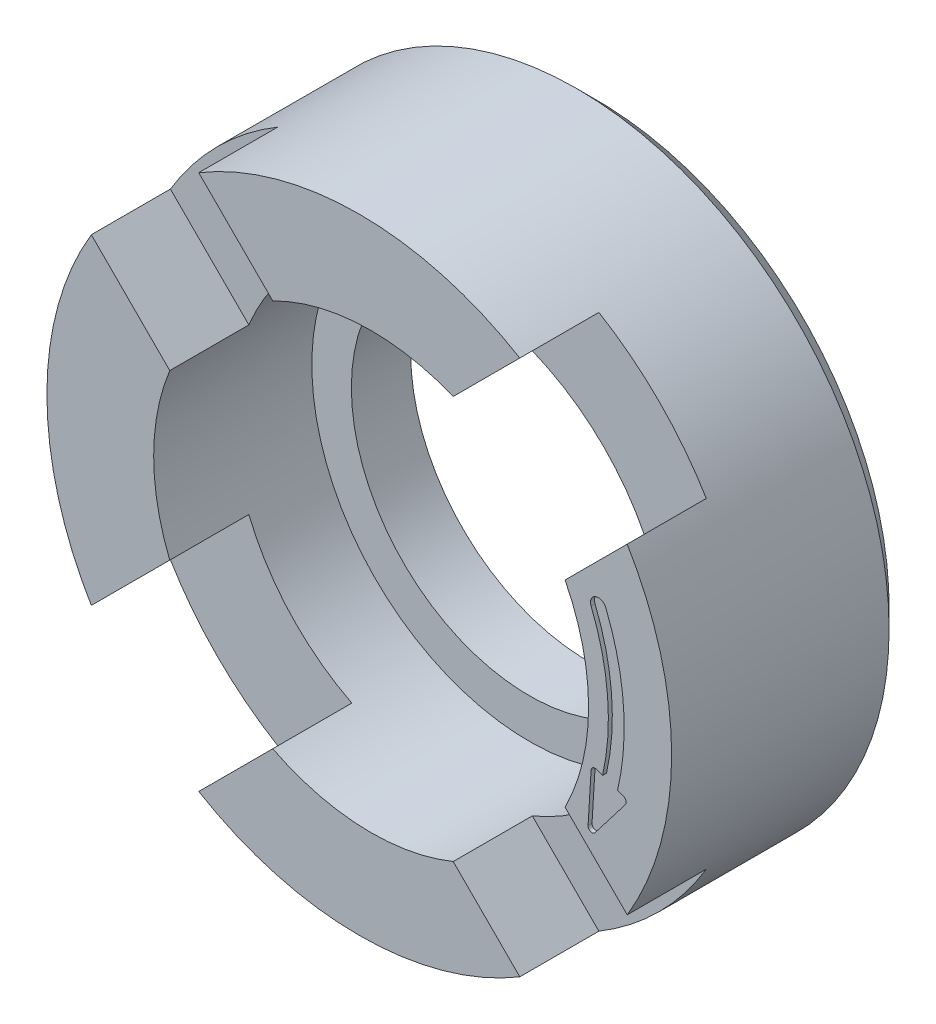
ISO-10303-21;
HEADER;
FILE_DESCRIPTION(('STEP AP214'),'2;1');
FILE_NAME('part.step','',(''),(''),'','','');
FILE_SCHEMA(('AUTOMOTIVE_DESIGN { 1 0 10303 214 1 1 1 1 }'));
ENDSEC;
DATA;
#1=APPLICATION_CONTEXT('core data for automotive mechanical design processes');
#2=APPLICATION_PROTOCOL_DEFINITION('international standard','automotive_design',2000,#1);
#3=PRODUCT_CONTEXT('',#1,'mechanical');
#4=PRODUCT('Part','Part','',(#3));
#5=PRODUCT_RELATED_PRODUCT_CATEGORY('part','',(#4));
#6=PRODUCT_DEFINITION_FORMATION('','',#4);
#7=PRODUCT_DEFINITION_CONTEXT('part definition',#1,'design');
#8=PRODUCT_DEFINITION('design','',#6,#7);
#9=PRODUCT_DEFINITION_SHAPE('','',#8);
#10=(LENGTH_UNIT() NAMED_UNIT(*) SI_UNIT(.MILLI.,.METRE.));
#11=(NAMED_UNIT(*) PLANE_ANGLE_UNIT() SI_UNIT($,.RADIAN.));
#12=(NAMED_UNIT(*) SI_UNIT($,.STERADIAN.) SOLID_ANGLE_UNIT());
#13=UNCERTAINTY_MEASURE_WITH_UNIT(LENGTH_MEASURE(1.E-05),#10,'distance_accuracy_value','');
#14=(GEOMETRIC_REPRESENTATION_CONTEXT(3) GLOBAL_UNCERTAINTY_ASSIGNED_CONTEXT((#13)) GLOBAL_UNIT_ASSIGNED_CONTEXT((#10,
#11,#12)) REPRESENTATION_CONTEXT('',''));
#15=CARTESIAN_POINT('',(0.,0.,0.));
#16=DIRECTION('',(0.,0.,1.));
#17=DIRECTION('',(1.,0.,0.));
#18=AXIS2_PLACEMENT_3D('',#15,#16,#17);
#19=CARTESIAN_POINT('',(1.5,0.,2.5));
#20=DIRECTION('',(0.,0.,-1.));
#21=DIRECTION('',(1.,0.,0.));
#22=AXIS2_PLACEMENT_3D('',#19,#20,#21);
#23=CYLINDRICAL_SURFACE('',#22,27.);
#24=CARTESIAN_POINT('',(1.5,0.,2.5));
#25=DIRECTION('',(0.,0.,-1.));
#26=DIRECTION('',(1.,0.,0.));
#27=AXIS2_PLACEMENT_3D('',#24,#25,#26);
#28=CIRCLE('',#27,27.);
#29=CARTESIAN_POINT('',(28.5,0.,2.5));
#30=VERTEX_POINT('',#29);
#31=EDGE_CURVE('E18',#30,#30,#28,.F.);
#32=ORIENTED_EDGE('',*,*,#31,.T.);
#33=EDGE_LOOP('',(#32));
#34=FACE_BOUND('',#33,.T.);
#35=CARTESIAN_POINT('',(1.5,0.,0.));
#36=DIRECTION('',(0.,0.,-1.));
#37=DIRECTION('',(1.,0.,0.));
#38=AXIS2_PLACEMENT_3D('',#35,#36,#37);
#39=CIRCLE('',#38,27.);
#40=CARTESIAN_POINT('',(28.5,0.,0.));
#41=VERTEX_POINT('',#40);
#42=EDGE_CURVE('E195',#41,#41,#39,.T.);
#43=ORIENTED_EDGE('',*,*,#42,.T.);
#44=EDGE_LOOP('',(#43));
#45=FACE_BOUND('',#44,.T.);
#46=ADVANCED_FACE('F14',(#34,#45),#23,.F.);
#47=CARTESIAN_POINT('',(-25.824,27.324,2.5));
#48=DIRECTION('',(0.,0.,1.));
#49=DIRECTION('',(0.,-1.,0.));
#50=AXIS2_PLACEMENT_3D('',#47,#48,#49);
#51=PLANE('',#50);
#52=CARTESIAN_POINT('',(1.5,0.,2.5));
#53=DIRECTION('',(0.,0.,-1.));
#54=DIRECTION('',(1.,0.,0.));
#55=AXIS2_PLACEMENT_3D('',#52,#53,#54);
#56=CIRCLE('',#55,22.5);
#57=CARTESIAN_POINT('',(24.,0.,2.5));
#58=VERTEX_POINT('',#57);
#59=EDGE_CURVE('E214',#58,#58,#56,.T.);
#60=ORIENTED_EDGE('',*,*,#59,.F.);
#61=EDGE_LOOP('',(#60));
#62=FACE_BOUND('',#61,.T.);
#63=ORIENTED_EDGE('',*,*,#31,.F.);
#64=EDGE_LOOP('',(#63));
#65=FACE_BOUND('',#64,.T.);
#66=ADVANCED_FACE('F360',(#62,#65),#51,.F.);
#67=CARTESIAN_POINT('',(-37.444,37.444,0.));
#68=DIRECTION('',(0.,0.,1.));
#69=DIRECTION('',(0.,-1.,0.));
#70=AXIS2_PLACEMENT_3D('',#67,#68,#69);
#71=PLANE('',#70);
#72=ORIENTED_EDGE('',*,*,#42,.F.);
#73=EDGE_LOOP('',(#72));
#74=FACE_BOUND('',#73,.T.);
#75=CARTESIAN_POINT('',(0.,0.,0.));
#76=DIRECTION('',(0.,0.,1.));
#77=DIRECTION('',(0.,-1.,0.));
#78=AXIS2_PLACEMENT_3D('',#75,#76,#77);
#79=CIRCLE('',#78,37.);
#80=CARTESIAN_POINT('',(0.,-37.,0.));
#81=VERTEX_POINT('',#80);
#82=EDGE_CURVE('E211',#81,#81,#79,.F.);
#83=ORIENTED_EDGE('',*,*,#82,.T.);
#84=EDGE_LOOP('',(#83));
#85=FACE_BOUND('',#84,.T.);
#86=ADVANCED_FACE('F362',(#74,#85),#71,.F.);
#87=CARTESIAN_POINT('',(-10.941262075,24.524783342,20.));
#88=DIRECTION('',(0.707106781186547,0.707106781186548,0.));
#89=DIRECTION('',(-0.707106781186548,0.707106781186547,0.));
#90=AXIS2_PLACEMENT_3D('',#87,#88,#89);
#91=PLANE('',#90);
#92=DIRECTION('',(0.,0.,1.));
#93=VECTOR('',#92,1.);
#94=CARTESIAN_POINT('',(-10.9412620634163,24.5247833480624,20.));
#95=LINE('',#94,#93);
#96=CARTESIAN_POINT('',(-10.9412620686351,24.5247833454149,30.));
#97=VERTEX_POINT('',#96);
#98=CARTESIAN_POINT('',(-10.9412620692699,24.5247833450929,20.));
#99=VERTEX_POINT('',#98);
#100=EDGE_CURVE('E218',#97,#99,#95,.F.);
#101=ORIENTED_EDGE('',*,*,#100,.F.);
#102=DIRECTION('',(0.707106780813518,-0.707106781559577,0.));
#103=VECTOR('',#102,1.);
#104=CARTESIAN_POINT('',(-20.3006181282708,33.8841394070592,30.));
#105=LINE('',#104,#103);
#106=CARTESIAN_POINT('',(-20.3006181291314,33.8841394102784,30.));
#107=VERTEX_POINT('',#106);
#108=EDGE_CURVE('E210',#107,#97,#105,.T.);
#109=ORIENTED_EDGE('',*,*,#108,.F.);
#110=DIRECTION('',(0.,0.,1.));
#111=VECTOR('',#110,1.);
#112=CARTESIAN_POINT('',(-20.3006181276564,33.8841394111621,16.25));
#113=LINE('',#112,#111);
#114=CARTESIAN_POINT('',(-20.3006181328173,33.8841394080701,19.99999999));
#115=VERTEX_POINT('',#114);
#116=EDGE_CURVE('E202',#107,#115,#113,.F.);
#117=ORIENTED_EDGE('',*,*,#116,.T.);
#118=DIRECTION('',(-0.707106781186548,0.707106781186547,0.));
#119=VECTOR('',#118,1.);
#120=CARTESIAN_POINT('',(-10.941262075,24.524783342,20.));
#121=LINE('',#120,#119);
#122=EDGE_CURVE('E185',#115,#99,#121,.F.);
#123=ORIENTED_EDGE('',*,*,#122,.T.);
#124=EDGE_LOOP('',(#101,#109,#117,#123));
#125=FACE_BOUND('',#124,.T.);
#126=ADVANCED_FACE('F208',(#125),#91,.F.);
#127=CARTESIAN_POINT('',(-10.803604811,10.240584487,20.));
#128=DIRECTION('',(0.,0.,-1.));
#129=DIRECTION('',(-1.,0.,0.));
#130=AXIS2_PLACEMENT_3D('',#127,#128,#129);
#131=PLANE('',#130);
#132=CARTESIAN_POINT('',(1.5,0.,20.));
#133=DIRECTION('',(0.,0.,-1.));
#134=DIRECTION('',(1.,0.,0.));
#135=AXIS2_PLACEMENT_3D('',#132,#133,#134);
#136=CIRCLE('',#135,27.5);
#137=CARTESIAN_POINT('',(-23.965120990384,10.3815997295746,20.));
#138=VERTEX_POINT('',#137);
#139=EDGE_CURVE('E190',#99,#138,#136,.F.);
#140=ORIENTED_EDGE('',*,*,#139,.F.);
#141=ORIENTED_EDGE('',*,*,#122,.F.);
#142=CARTESIAN_POINT('',(0.,0.,19.99999999));
#143=DIRECTION('',(0.,0.,-1.));
#144=DIRECTION('',(1.,0.,0.));
#145=AXIS2_PLACEMENT_3D('',#142,#143,#144);
#146=CIRCLE('',#145,39.5);
#147=CARTESIAN_POINT('',(-33.8841394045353,20.3006181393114,19.999999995));
#148=VERTEX_POINT('',#147);
#149=EDGE_CURVE('E189',#115,#148,#146,.F.);
#150=ORIENTED_EDGE('',*,*,#149,.T.);
#151=DIRECTION('',(0.707106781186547,-0.707106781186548,0.));
#152=VECTOR('',#151,1.);
#153=CARTESIAN_POINT('',(-28.9246301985,15.3411089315,20.));
#154=LINE('',#153,#152);
#155=EDGE_CURVE('E194',#148,#138,#154,.T.);
#156=ORIENTED_EDGE('',*,*,#155,.T.);
#157=EDGE_LOOP('',(#140,#141,#150,#156));
#158=FACE_BOUND('',#157,.T.);
#159=ADVANCED_FACE('F187',(#158),#131,.F.);
#160=CARTESIAN_POINT('',(-33.884139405,20.300618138,20.));
#161=DIRECTION('',(-0.707106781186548,-0.707106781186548,0.));
#162=DIRECTION('',(0.707106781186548,-0.707106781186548,0.));
#163=AXIS2_PLACEMENT_3D('',#160,#161,#162);
#164=PLANE('',#163);
#165=DIRECTION('',(0.,0.,-1.));
#166=VECTOR('',#165,1.);
#167=CARTESIAN_POINT('',(-23.9651209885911,10.3815997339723,20.));
#168=LINE('',#167,#166);
#169=CARTESIAN_POINT('',(-23.9651209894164,10.3815997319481,30.));
#170=VERTEX_POINT('',#169);
#171=EDGE_CURVE('E329',#138,#170,#168,.F.);
#172=ORIENTED_EDGE('',*,*,#171,.F.);
#173=ORIENTED_EDGE('',*,*,#155,.F.);
#174=DIRECTION('',(0.,0.,-1.));
#175=VECTOR('',#174,1.);
#176=CARTESIAN_POINT('',(-33.8841394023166,20.3006181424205,16.25));
#177=LINE('',#176,#175);
#178=CARTESIAN_POINT('',(-33.8841394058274,20.3006181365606,30.));
#179=VERTEX_POINT('',#178);
#180=EDGE_CURVE('E206',#148,#179,#177,.F.);
#181=ORIENTED_EDGE('',*,*,#180,.T.);
#182=DIRECTION('',(-0.707106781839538,0.707106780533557,0.));
#183=VECTOR('',#182,1.);
#184=CARTESIAN_POINT('',(-23.9651209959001,10.3815997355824,30.));
#185=LINE('',#184,#183);
#186=EDGE_CURVE('E352',#170,#179,#185,.T.);
#187=ORIENTED_EDGE('',*,*,#186,.F.);
#188=EDGE_LOOP('',(#172,#173,#181,#187));
#189=FACE_BOUND('',#188,.T.);
#190=ADVANCED_FACE('F521',(#189),#164,.F.);
#191=CARTESIAN_POINT('',(-39.593209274,20.544225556,30.));
#192=DIRECTION('',(0.,0.,1.));
#193=DIRECTION('',(0.,-1.,0.));
#194=AXIS2_PLACEMENT_3D('',#191,#192,#193);
#195=PLANE('',#194);
#196=DIRECTION('',(0.707106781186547,0.707106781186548,0.));
#197=VECTOR('',#196,1.);
#198=CARTESIAN_POINT('',(-28.9246301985,-15.3411089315,30.));
#199=LINE('',#198,#197);
#200=CARTESIAN_POINT('',(-33.8841394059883,-20.3006181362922,30.));
#201=VERTEX_POINT('',#200);
#202=CARTESIAN_POINT('',(-23.9651209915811,-10.3815997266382,30.));
#203=VERTEX_POINT('',#202);
#204=EDGE_CURVE('E351',#201,#203,#199,.T.);
#205=ORIENTED_EDGE('',*,*,#204,.T.);
#206=CARTESIAN_POINT('',(1.5,0.,30.));
#207=DIRECTION('',(0.,0.,-1.));
#208=DIRECTION('',(1.,0.,0.));
#209=AXIS2_PLACEMENT_3D('',#206,#207,#208);
#210=CIRCLE('',#209,27.5);
#211=EDGE_CURVE('E327',#170,#203,#210,.F.);
#212=ORIENTED_EDGE('',*,*,#211,.F.);
#213=ORIENTED_EDGE('',*,*,#186,.T.);
#214=CARTESIAN_POINT('',(0.,0.,30.));
#215=DIRECTION('',(0.,0.,-1.));
#216=DIRECTION('',(1.,0.,0.));
#217=AXIS2_PLACEMENT_3D('',#214,#215,#216);
#218=CIRCLE('',#217,39.5);
#219=EDGE_CURVE('E228',#179,#201,#218,.F.);
#220=ORIENTED_EDGE('',*,*,#219,.T.);
#221=EDGE_LOOP('',(#205,#212,#213,#220));
#222=FACE_BOUND('',#221,.T.);
#223=ADVANCED_FACE('F551',(#222),#195,.T.);
#224=CARTESIAN_POINT('',(-23.965120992,-10.381599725,20.));
#225=DIRECTION('',(-0.707106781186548,0.707106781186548,0.));
#226=DIRECTION('',(-0.707106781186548,-0.707106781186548,0.));
#227=AXIS2_PLACEMENT_3D('',#224,#225,#226);
#228=PLANE('',#227);
#229=DIRECTION('',(0.,0.,1.));
#230=VECTOR('',#229,1.);
#231=CARTESIAN_POINT('',(-23.9651209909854,-10.3815997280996,20.));
#232=LINE('',#231,#230);
#233=CARTESIAN_POINT('',(-23.9651209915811,-10.3815997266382,20.));
#234=VERTEX_POINT('',#233);
#235=EDGE_CURVE('E326',#203,#234,#232,.F.);
#236=ORIENTED_EDGE('',*,*,#235,.F.);
#237=ORIENTED_EDGE('',*,*,#204,.F.);
#238=DIRECTION('',(0.,0.,1.));
#239=VECTOR('',#238,1.);
#240=CARTESIAN_POINT('',(-33.8841394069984,-20.3006181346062,16.25));
#241=LINE('',#240,#239);
#242=CARTESIAN_POINT('',(-33.8841394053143,-20.3006181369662,19.999999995));
#243=VERTEX_POINT('',#242);
#244=EDGE_CURVE('E225',#201,#243,#241,.F.);
#245=ORIENTED_EDGE('',*,*,#244,.T.);
#246=DIRECTION('',(-0.707106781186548,-0.707106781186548,0.));
#247=VECTOR('',#246,1.);
#248=CARTESIAN_POINT('',(-23.965120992,-10.381599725,20.));
#249=LINE('',#248,#247);
#250=EDGE_CURVE('E348',#243,#234,#249,.F.);
#251=ORIENTED_EDGE('',*,*,#250,.T.);
#252=EDGE_LOOP('',(#236,#237,#245,#251));
#253=FACE_BOUND('',#252,.T.);
#254=ADVANCED_FACE('F549',(#253),#228,.F.);
#255=CARTESIAN_POINT('',(-10.803604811,-10.240584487,20.));
#256=DIRECTION('',(0.,0.,-1.));
#257=DIRECTION('',(0.,-1.,0.));
#258=AXIS2_PLACEMENT_3D('',#255,#256,#257);
#259=PLANE('',#258);
#260=CARTESIAN_POINT('',(1.5,0.,20.));
#261=DIRECTION('',(0.,0.,-1.));
#262=DIRECTION('',(1.,0.,0.));
#263=AXIS2_PLACEMENT_3D('',#260,#261,#262);
#264=CIRCLE('',#263,27.5);
#265=CARTESIAN_POINT('',(-10.9412620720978,-24.5247833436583,20.));
#266=VERTEX_POINT('',#265);
#267=EDGE_CURVE('E324',#234,#266,#264,.F.);
#268=ORIENTED_EDGE('',*,*,#267,.F.);
#269=ORIENTED_EDGE('',*,*,#250,.F.);
#270=CARTESIAN_POINT('',(0.,0.,19.99999999));
#271=DIRECTION('',(0.,0.,-1.));
#272=DIRECTION('',(1.,0.,0.));
#273=AXIS2_PLACEMENT_3D('',#270,#271,#272);
#274=CIRCLE('',#273,39.5);
#275=CARTESIAN_POINT('',(-20.3006181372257,-33.884139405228,19.999999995));
#276=VERTEX_POINT('',#275);
#277=EDGE_CURVE('E224',#243,#276,#274,.F.);
#278=ORIENTED_EDGE('',*,*,#277,.T.);
#279=DIRECTION('',(0.707106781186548,0.707106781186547,0.));
#280=VECTOR('',#279,1.);
#281=CARTESIAN_POINT('',(-15.6209401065,-29.2044613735,20.));
#282=LINE('',#281,#280);
#283=EDGE_CURVE('E347',#276,#266,#282,.T.);
#284=ORIENTED_EDGE('',*,*,#283,.T.);
#285=EDGE_LOOP('',(#268,#269,#278,#284));
#286=FACE_BOUND('',#285,.T.);
#287=ADVANCED_FACE('F430',(#286),#259,.F.);
#288=CARTESIAN_POINT('',(-20.300618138,-33.884139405,20.));
#289=DIRECTION('',(0.707106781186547,-0.707106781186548,0.));
#290=DIRECTION('',(0.707106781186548,0.707106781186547,0.));
#291=AXIS2_PLACEMENT_3D('',#288,#289,#290);
#292=PLANE('',#291);
#293=DIRECTION('',(0.,0.,-1.));
#294=VECTOR('',#293,1.);
#295=CARTESIAN_POINT('',(-10.9412620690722,-24.5247833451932,20.));
#296=LINE('',#295,#294);
#297=CARTESIAN_POINT('',(-10.9412620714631,-24.5247833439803,30.));
#298=VERTEX_POINT('',#297);
#299=EDGE_CURVE('E323',#266,#298,#296,.F.);
#300=ORIENTED_EDGE('',*,*,#299,.F.);
#301=ORIENTED_EDGE('',*,*,#283,.F.);
#302=DIRECTION('',(0.,0.,-1.));
#303=VECTOR('',#302,1.);
#304=CARTESIAN_POINT('',(-20.3006181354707,-33.8841394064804,16.25));
#305=LINE('',#304,#303);
#306=CARTESIAN_POINT('',(-20.3006181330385,-33.8841394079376,30.));
#307=VERTEX_POINT('',#306);
#308=EDGE_CURVE('E220',#276,#307,#305,.F.);
#309=ORIENTED_EDGE('',*,*,#308,.T.);
#310=DIRECTION('',(-0.707106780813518,-0.707106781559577,0.));
#311=VECTOR('',#310,1.);
#312=CARTESIAN_POINT('',(-10.941262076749,-24.5247833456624,30.));
#313=LINE('',#312,#311);
#314=EDGE_CURVE('E223',#298,#307,#313,.T.);
#315=ORIENTED_EDGE('',*,*,#314,.F.);
#316=EDGE_LOOP('',(#300,#301,#309,#315));
#317=FACE_BOUND('',#316,.T.);
#318=ADVANCED_FACE('F424',(#317),#292,.F.);
#319=CARTESIAN_POINT('',(1.5,0.,10.));
#320=DIRECTION('',(0.,0.,-1.));
#321=DIRECTION('',(1.,0.,0.));
#322=AXIS2_PLACEMENT_3D('',#319,#320,#321);
#323=CYLINDRICAL_SURFACE('',#322,22.5);
#324=CARTESIAN_POINT('',(1.5,0.,10.));
#325=DIRECTION('',(0.,0.,-1.));
#326=DIRECTION('',(1.,0.,0.));
#327=AXIS2_PLACEMENT_3D('',#324,#325,#326);
#328=CIRCLE('',#327,22.5);
#329=CARTESIAN_POINT('',(24.,0.,10.));
#330=VERTEX_POINT('',#329);
#331=EDGE_CURVE('E319',#330,#330,#328,.F.);
#332=ORIENTED_EDGE('',*,*,#331,.T.);
#333=EDGE_LOOP('',(#332));
#334=FACE_BOUND('',#333,.T.);
#335=ORIENTED_EDGE('',*,*,#59,.T.);
#336=EDGE_LOOP('',(#335));
#337=FACE_BOUND('',#336,.T.);
#338=ADVANCED_FACE('F421',(#334,#337),#323,.F.);
#339=CARTESIAN_POINT('',(0.,0.,0.));
#340=DIRECTION('',(0.,0.,1.));
#341=DIRECTION('',(0.,-1.,0.));
#342=AXIS2_PLACEMENT_3D('',#339,#340,#341);
#343=CONICAL_SURFACE('',#342,37.,0.785398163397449);
#344=CARTESIAN_POINT('',(0.,0.,2.5));
#345=DIRECTION('',(0.,0.,-1.));
#346=DIRECTION('',(0.,1.,0.));
#347=AXIS2_PLACEMENT_3D('',#344,#345,#346);
#348=CIRCLE('',#347,39.5);
#349=CARTESIAN_POINT('',(0.,39.5,2.5));
#350=VERTEX_POINT('',#349);
#351=EDGE_CURVE('E307',#350,#350,#348,.T.);
#352=ORIENTED_EDGE('',*,*,#351,.T.);
#353=EDGE_LOOP('',(#352));
#354=FACE_BOUND('',#353,.T.);
#355=ORIENTED_EDGE('',*,*,#82,.F.);
#356=EDGE_LOOP('',(#355));
#357=FACE_BOUND('',#356,.T.);
#358=ADVANCED_FACE('F417',(#354,#357),#343,.T.);
#359=CARTESIAN_POINT('',(-20.544225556,-24.434932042,30.));
#360=DIRECTION('',(0.,0.,1.));
#361=DIRECTION('',(0.,-1.,0.));
#362=AXIS2_PLACEMENT_3D('',#359,#360,#361);
#363=PLANE('',#362);
#364=CARTESIAN_POINT('',(1.5,0.,30.));
#365=DIRECTION('',(0.,0.,-1.));
#366=DIRECTION('',(1.,0.,0.));
#367=AXIS2_PLACEMENT_3D('',#364,#365,#366);
#368=CIRCLE('',#367,27.5);
#369=CARTESIAN_POINT('',(11.8815997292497,-25.4651209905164,30.));
#370=VERTEX_POINT('',#369);
#371=EDGE_CURVE('E300',#298,#370,#368,.F.);
#372=ORIENTED_EDGE('',*,*,#371,.F.);
#373=ORIENTED_EDGE('',*,*,#314,.T.);
#374=CARTESIAN_POINT('',(0.,0.,30.));
#375=DIRECTION('',(0.,0.,-1.));
#376=DIRECTION('',(1.,0.,0.));
#377=AXIS2_PLACEMENT_3D('',#374,#375,#376);
#378=CIRCLE('',#377,39.5);
#379=CARTESIAN_POINT('',(20.300618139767,-33.8841394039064,30.));
#380=VERTEX_POINT('',#379);
#381=EDGE_CURVE('E303',#307,#380,#378,.F.);
#382=ORIENTED_EDGE('',*,*,#381,.T.);
#383=DIRECTION('',(-0.707106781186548,0.707106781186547,0.));
#384=VECTOR('',#383,1.);
#385=CARTESIAN_POINT('',(16.0911089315,-29.6746301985,30.));
#386=LINE('',#385,#384);
#387=EDGE_CURVE('E338',#380,#370,#386,.T.);
#388=ORIENTED_EDGE('',*,*,#387,.T.);
#389=EDGE_LOOP('',(#372,#373,#382,#388));
#390=FACE_BOUND('',#389,.T.);
#391=ADVANCED_FACE('F420',(#390),#363,.T.);
#392=CARTESIAN_POINT('',(11.881599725,-25.465120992,20.));
#393=DIRECTION('',(-0.707106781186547,-0.707106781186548,0.));
#394=DIRECTION('',(0.707106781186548,-0.707106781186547,0.));
#395=AXIS2_PLACEMENT_3D('',#392,#393,#394);
#396=PLANE('',#395);
#397=DIRECTION('',(0.,0.,1.));
#398=VECTOR('',#397,1.);
#399=CARTESIAN_POINT('',(11.8815997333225,-25.4651209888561,20.));
#400=LINE('',#399,#398);
#401=CARTESIAN_POINT('',(11.8815997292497,-25.4651209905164,20.));
#402=VERTEX_POINT('',#401);
#403=EDGE_CURVE('E299',#370,#402,#400,.F.);
#404=ORIENTED_EDGE('',*,*,#403,.F.);
#405=ORIENTED_EDGE('',*,*,#387,.F.);
#406=DIRECTION('',(0.,0.,1.));
#407=VECTOR('',#406,1.);
#408=CARTESIAN_POINT('',(20.3006181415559,-33.8841394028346,16.25));
#409=LINE('',#408,#407);
#410=CARTESIAN_POINT('',(20.3006181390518,-33.8841394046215,19.999999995));
#411=VERTEX_POINT('',#410);
#412=EDGE_CURVE('E318',#380,#411,#409,.F.);
#413=ORIENTED_EDGE('',*,*,#412,.T.);
#414=DIRECTION('',(0.707106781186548,-0.707106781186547,0.));
#415=VECTOR('',#414,1.);
#416=CARTESIAN_POINT('',(11.881599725,-25.465120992,20.));
#417=LINE('',#416,#415);
#418=EDGE_CURVE('E335',#411,#402,#417,.F.);
#419=ORIENTED_EDGE('',*,*,#418,.T.);
#420=EDGE_LOOP('',(#404,#405,#413,#419));
#421=FACE_BOUND('',#420,.T.);
#422=ADVANCED_FACE('F538',(#421),#396,.F.);
#423=CARTESIAN_POINT('',(11.749584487,-12.312604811,20.));
#424=DIRECTION('',(0.,0.,-1.));
#425=DIRECTION('',(1.,0.,0.));
#426=AXIS2_PLACEMENT_3D('',#423,#424,#425);
#427=PLANE('',#426);
#428=CARTESIAN_POINT('',(1.5,0.,20.));
#429=DIRECTION('',(0.,0.,-1.));
#430=DIRECTION('',(1.,0.,0.));
#431=AXIS2_PLACEMENT_3D('',#428,#429,#430);
#432=CIRCLE('',#431,27.5);
#433=CARTESIAN_POINT('',(26.0247833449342,-12.4412620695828,20.));
#434=VERTEX_POINT('',#433);
#435=EDGE_CURVE('E296',#402,#434,#432,.F.);
#436=ORIENTED_EDGE('',*,*,#435,.F.);
#437=ORIENTED_EDGE('',*,*,#418,.F.);
#438=CARTESIAN_POINT('',(0.,0.,19.99999999));
#439=DIRECTION('',(0.,0.,-1.));
#440=DIRECTION('',(1.,0.,0.));
#441=AXIS2_PLACEMENT_3D('',#438,#439,#440);
#442=CIRCLE('',#441,39.5);
#443=CARTESIAN_POINT('',(33.8841394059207,-20.3006181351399,19.999999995));
#444=VERTEX_POINT('',#443);
#445=EDGE_CURVE('E315',#411,#444,#442,.F.);
#446=ORIENTED_EDGE('',*,*,#445,.T.);
#447=DIRECTION('',(-0.707106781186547,0.707106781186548,0.));
#448=VECTOR('',#447,1.);
#449=CARTESIAN_POINT('',(29.9544613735,-16.3709401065,20.));
#450=LINE('',#449,#448);
#451=EDGE_CURVE('E322',#444,#434,#450,.T.);
#452=ORIENTED_EDGE('',*,*,#451,.T.);
#453=EDGE_LOOP('',(#436,#437,#446,#452));
#454=FACE_BOUND('',#453,.T.);
#455=ADVANCED_FACE('F535',(#454),#427,.F.);
#456=CARTESIAN_POINT('',(11.749584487,12.312604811,20.));
#457=DIRECTION('',(0.,0.,-1.));
#458=DIRECTION('',(0.,1.,0.));
#459=AXIS2_PLACEMENT_3D('',#456,#457,#458);
#460=PLANE('',#459);
#461=CARTESIAN_POINT('',(1.5,0.,20.));
#462=DIRECTION('',(0.,0.,-1.));
#463=DIRECTION('',(1.,0.,0.));
#464=AXIS2_PLACEMENT_3D('',#461,#462,#463);
#465=CIRCLE('',#464,27.5);
#466=CARTESIAN_POINT('',(26.0247833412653,12.441262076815,20.));
#467=VERTEX_POINT('',#466);
#468=CARTESIAN_POINT('',(11.8815997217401,25.465120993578,20.));
#469=VERTEX_POINT('',#468);
#470=EDGE_CURVE('E293',#467,#469,#465,.F.);
#471=ORIENTED_EDGE('',*,*,#470,.F.);
#472=DIRECTION('',(0.707106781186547,0.707106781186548,0.));
#473=VECTOR('',#472,1.);
#474=CARTESIAN_POINT('',(29.9544613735,16.3709401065,20.));
#475=LINE('',#474,#473);
#476=CARTESIAN_POINT('',(33.884139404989,20.3006181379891,19.999999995));
#477=VERTEX_POINT('',#476);
#478=EDGE_CURVE('E302',#467,#477,#475,.T.);
#479=ORIENTED_EDGE('',*,*,#478,.T.);
#480=CARTESIAN_POINT('',(0.,0.,19.99999999));
#481=DIRECTION('',(0.,0.,-1.));
#482=DIRECTION('',(1.,0.,0.));
#483=AXIS2_PLACEMENT_3D('',#480,#481,#482);
#484=CIRCLE('',#483,39.5);
#485=CARTESIAN_POINT('',(20.3006181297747,33.884139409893,19.99999999));
#486=VERTEX_POINT('',#485);
#487=EDGE_CURVE('E311',#477,#486,#484,.F.);
#488=ORIENTED_EDGE('',*,*,#487,.T.);
#489=DIRECTION('',(-0.707106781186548,-0.707106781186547,0.));
#490=VECTOR('',#489,1.);
#491=CARTESIAN_POINT('',(16.0911089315,29.6746301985,20.));
#492=LINE('',#491,#490);
#493=EDGE_CURVE('E334',#486,#469,#492,.T.);
#494=ORIENTED_EDGE('',*,*,#493,.T.);
#495=EDGE_LOOP('',(#471,#479,#488,#494));
#496=FACE_BOUND('',#495,.T.);
#497=ADVANCED_FACE('F530',(#496),#460,.F.);
#498=CARTESIAN_POINT('',(20.300618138,33.884139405,20.));
#499=DIRECTION('',(-0.707106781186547,0.707106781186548,0.));
#500=DIRECTION('',(-0.707106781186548,-0.707106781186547,0.));
#501=AXIS2_PLACEMENT_3D('',#498,#499,#500);
#502=PLANE('',#501);
#503=DIRECTION('',(0.,0.,-1.));
#504=VECTOR('',#503,1.);
#505=CARTESIAN_POINT('',(11.8815997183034,25.465120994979,20.));
#506=LINE('',#505,#504);
#507=CARTESIAN_POINT('',(11.8815997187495,25.4651209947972,30.));
#508=VERTEX_POINT('',#507);
#509=EDGE_CURVE('E292',#469,#508,#506,.F.);
#510=ORIENTED_EDGE('',*,*,#509,.F.);
#511=ORIENTED_EDGE('',*,*,#493,.F.);
#512=DIRECTION('',(0.,0.,-1.));
#513=VECTOR('',#512,1.);
#514=CARTESIAN_POINT('',(20.3006181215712,33.8841394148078,16.25));
#515=LINE('',#514,#513);
#516=CARTESIAN_POINT('',(20.3006181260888,33.8841394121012,30.));
#517=VERTEX_POINT('',#516);
#518=EDGE_CURVE('E310',#486,#517,#515,.F.);
#519=ORIENTED_EDGE('',*,*,#518,.T.);
#520=DIRECTION('',(0.707106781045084,0.707106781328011,0.));
#521=VECTOR('',#520,1.);
#522=CARTESIAN_POINT('',(11.8815997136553,25.4651209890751,30.));
#523=LINE('',#522,#521);
#524=EDGE_CURVE('E331',#508,#517,#523,.T.);
#525=ORIENTED_EDGE('',*,*,#524,.F.);
#526=EDGE_LOOP('',(#510,#511,#519,#525));
#527=FACE_BOUND('',#526,.T.);
#528=ADVANCED_FACE('F450',(#527),#502,.F.);
#529=CARTESIAN_POINT('',(-20.544225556,39.5898513,30.));
#530=DIRECTION('',(0.,0.,1.));
#531=DIRECTION('',(0.,-1.,0.));
#532=AXIS2_PLACEMENT_3D('',#529,#530,#531);
#533=PLANE('',#532);
#534=CARTESIAN_POINT('',(0.,0.,30.));
#535=DIRECTION('',(0.,0.,-1.));
#536=DIRECTION('',(1.,0.,0.));
#537=AXIS2_PLACEMENT_3D('',#534,#535,#536);
#538=CIRCLE('',#537,39.5);
#539=EDGE_CURVE('E308',#517,#107,#538,.F.);
#540=ORIENTED_EDGE('',*,*,#539,.T.);
#541=ORIENTED_EDGE('',*,*,#108,.T.);
#542=CARTESIAN_POINT('',(1.5,0.,30.));
#543=DIRECTION('',(0.,0.,-1.));
#544=DIRECTION('',(1.,0.,0.));
#545=AXIS2_PLACEMENT_3D('',#542,#543,#544);
#546=CIRCLE('',#545,27.5);
#547=EDGE_CURVE('E290',#508,#97,#546,.F.);
#548=ORIENTED_EDGE('',*,*,#547,.F.);
#549=ORIENTED_EDGE('',*,*,#524,.T.);
#550=EDGE_LOOP('',(#540,#541,#548,#549));
#551=FACE_BOUND('',#550,.T.);
#552=ADVANCED_FACE('F439',(#551),#533,.T.);
#553=CARTESIAN_POINT('',(-26.33,-27.83,10.));
#554=DIRECTION('',(0.,0.,-1.));
#555=DIRECTION('',(0.,1.,0.));
#556=AXIS2_PLACEMENT_3D('',#553,#554,#555);
#557=PLANE('',#556);
#558=ORIENTED_EDGE('',*,*,#331,.F.);
#559=EDGE_LOOP('',(#558));
#560=FACE_BOUND('',#559,.T.);
#561=CARTESIAN_POINT('',(1.5,0.,10.));
#562=DIRECTION('',(0.,0.,-1.));
#563=DIRECTION('',(1.,0.,0.));
#564=AXIS2_PLACEMENT_3D('',#561,#562,#563);
#565=CIRCLE('',#564,27.5);
#566=CARTESIAN_POINT('',(29.,0.,10.));
#567=VERTEX_POINT('',#566);
#568=EDGE_CURVE('E286',#567,#567,#565,.T.);
#569=ORIENTED_EDGE('',*,*,#568,.F.);
#570=EDGE_LOOP('',(#569));
#571=FACE_BOUND('',#570,.T.);
#572=ADVANCED_FACE('F436',(#560,#571),#557,.F.);
#573=CARTESIAN_POINT('',(33.884139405,-20.300618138,20.));
#574=DIRECTION('',(0.707106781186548,0.707106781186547,0.));
#575=DIRECTION('',(-0.707106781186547,0.707106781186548,0.));
#576=AXIS2_PLACEMENT_3D('',#573,#574,#575);
#577=PLANE('',#576);
#578=DIRECTION('',(0.,0.,-1.));
#579=VECTOR('',#578,1.);
#580=CARTESIAN_POINT('',(26.024783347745,-12.4412620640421,20.));
#581=LINE('',#580,#579);
#582=CARTESIAN_POINT('',(26.0247833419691,-12.4412620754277,30.));
#583=VERTEX_POINT('',#582);
#584=EDGE_CURVE('E298',#434,#583,#581,.F.);
#585=ORIENTED_EDGE('',*,*,#584,.F.);
#586=ORIENTED_EDGE('',*,*,#451,.F.);
#587=DIRECTION('',(0.,0.,-1.));
#588=VECTOR('',#587,1.);
#589=CARTESIAN_POINT('',(33.8841394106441,-20.300618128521,16.25));
#590=LINE('',#589,#588);
#591=CARTESIAN_POINT('',(33.8841394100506,-20.3006181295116,30.));
#592=VERTEX_POINT('',#591);
#593=EDGE_CURVE('E314',#444,#592,#590,.F.);
#594=ORIENTED_EDGE('',*,*,#593,.T.);
#595=DIRECTION('',(0.707106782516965,-0.70710677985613,0.));
#596=VECTOR('',#595,1.);
#597=CARTESIAN_POINT('',(26.0247833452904,-12.4412620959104,30.));
#598=LINE('',#597,#596);
#599=EDGE_CURVE('E259',#583,#592,#598,.T.);
#600=ORIENTED_EDGE('',*,*,#599,.F.);
#601=EDGE_LOOP('',(#585,#586,#594,#600));
#602=FACE_BOUND('',#601,.T.);
#603=ADVANCED_FACE('F415',(#602),#577,.F.);
#604=CARTESIAN_POINT('',(0.,0.,30.));
#605=DIRECTION('',(0.,0.,-1.));
#606=DIRECTION('',(1.,0.,0.));
#607=AXIS2_PLACEMENT_3D('',#604,#605,#606);
#608=CYLINDRICAL_SURFACE('',#607,39.5);
#609=ORIENTED_EDGE('',*,*,#351,.F.);
#610=EDGE_LOOP('',(#609));
#611=FACE_BOUND('',#610,.T.);
#612=ORIENTED_EDGE('',*,*,#381,.F.);
#613=ORIENTED_EDGE('',*,*,#308,.F.);
#614=ORIENTED_EDGE('',*,*,#277,.F.);
#615=ORIENTED_EDGE('',*,*,#244,.F.);
#616=ORIENTED_EDGE('',*,*,#219,.F.);
#617=ORIENTED_EDGE('',*,*,#180,.F.);
#618=ORIENTED_EDGE('',*,*,#149,.F.);
#619=ORIENTED_EDGE('',*,*,#116,.F.);
#620=ORIENTED_EDGE('',*,*,#539,.F.);
#621=ORIENTED_EDGE('',*,*,#518,.F.);
#622=ORIENTED_EDGE('',*,*,#487,.F.);
#623=DIRECTION('',(0.,0.,1.));
#624=VECTOR('',#623,1.);
#625=CARTESIAN_POINT('',(33.884139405,20.300618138,25.));
#626=LINE('',#625,#624);
#627=CARTESIAN_POINT('',(33.8841394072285,20.3006181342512,30.));
#628=VERTEX_POINT('',#627);
#629=EDGE_CURVE('E306',#477,#628,#626,.T.);
#630=ORIENTED_EDGE('',*,*,#629,.T.);
#631=CARTESIAN_POINT('',(0.,0.,30.));
#632=DIRECTION('',(0.,0.,-1.));
#633=DIRECTION('',(1.,0.,0.));
#634=AXIS2_PLACEMENT_3D('',#631,#632,#633);
#635=CIRCLE('',#634,39.5);
#636=EDGE_CURVE('E257',#592,#628,#635,.F.);
#637=ORIENTED_EDGE('',*,*,#636,.F.);
#638=ORIENTED_EDGE('',*,*,#593,.F.);
#639=ORIENTED_EDGE('',*,*,#445,.F.);
#640=ORIENTED_EDGE('',*,*,#412,.F.);
#641=EDGE_LOOP('',(#612,#613,#614,#615,#616,#617,#618,#619,#620,#621,#622,#630,#637,#638,#639,#640));
#642=FACE_BOUND('',#641,.T.);
#643=ADVANCED_FACE('F200',(#611,#642),#608,.T.);
#644=CARTESIAN_POINT('',(26.024783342,12.441262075,20.));
#645=DIRECTION('',(0.707106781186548,-0.707106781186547,0.));
#646=DIRECTION('',(0.707106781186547,0.707106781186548,0.));
#647=AXIS2_PLACEMENT_3D('',#644,#645,#646);
#648=PLANE('',#647);
#649=DIRECTION('',(0.,0.,1.));
#650=VECTOR('',#649,1.);
#651=CARTESIAN_POINT('',(26.0247833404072,12.4412620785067,20.));
#652=LINE('',#651,#650);
#653=CARTESIAN_POINT('',(26.0247833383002,12.4412620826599,30.));
#654=VERTEX_POINT('',#653);
#655=EDGE_CURVE('E295',#654,#467,#652,.F.);
#656=ORIENTED_EDGE('',*,*,#655,.F.);
#657=DIRECTION('',(-0.707106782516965,-0.707106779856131,0.));
#658=VECTOR('',#657,1.);
#659=CARTESIAN_POINT('',(33.8841394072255,20.3006181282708,30.));
#660=LINE('',#659,#658);
#661=EDGE_CURVE('E255',#628,#654,#660,.T.);
#662=ORIENTED_EDGE('',*,*,#661,.F.);
#663=ORIENTED_EDGE('',*,*,#629,.F.);
#664=ORIENTED_EDGE('',*,*,#478,.F.);
#665=EDGE_LOOP('',(#656,#662,#663,#664));
#666=FACE_BOUND('',#665,.T.);
#667=ADVANCED_FACE('F411',(#666),#648,.F.);
#668=CARTESIAN_POINT('',(1.5,0.,30.));
#669=DIRECTION('',(0.,0.,-1.));
#670=DIRECTION('',(1.,0.,0.));
#671=AXIS2_PLACEMENT_3D('',#668,#669,#670);
#672=CYLINDRICAL_SURFACE('',#671,27.5);
#673=ORIENTED_EDGE('',*,*,#299,.T.);
#674=ORIENTED_EDGE('',*,*,#371,.T.);
#675=ORIENTED_EDGE('',*,*,#403,.T.);
#676=ORIENTED_EDGE('',*,*,#435,.T.);
#677=ORIENTED_EDGE('',*,*,#584,.T.);
#678=CARTESIAN_POINT('',(1.5,0.,30.));
#679=DIRECTION('',(0.,0.,-1.));
#680=DIRECTION('',(1.,0.,0.));
#681=AXIS2_PLACEMENT_3D('',#678,#679,#680);
#682=CIRCLE('',#681,27.5);
#683=EDGE_CURVE('E252',#654,#583,#682,.T.);
#684=ORIENTED_EDGE('',*,*,#683,.F.);
#685=ORIENTED_EDGE('',*,*,#655,.T.);
#686=ORIENTED_EDGE('',*,*,#470,.T.);
#687=ORIENTED_EDGE('',*,*,#509,.T.);
#688=ORIENTED_EDGE('',*,*,#547,.T.);
#689=ORIENTED_EDGE('',*,*,#100,.T.);
#690=ORIENTED_EDGE('',*,*,#139,.T.);
#691=ORIENTED_EDGE('',*,*,#171,.T.);
#692=ORIENTED_EDGE('',*,*,#211,.T.);
#693=ORIENTED_EDGE('',*,*,#235,.T.);
#694=ORIENTED_EDGE('',*,*,#267,.T.);
#695=EDGE_LOOP('',(#673,#674,#675,#676,#677,#684,#685,#686,#687,#688,#689,#690,#691,#692,#693,#694));
#696=FACE_BOUND('',#695,.T.);
#697=ORIENTED_EDGE('',*,*,#568,.T.);
#698=EDGE_LOOP('',(#697));
#699=FACE_BOUND('',#698,.T.);
#700=ADVANCED_FACE('F407',(#696,#699),#672,.F.);
#701=CARTESIAN_POINT('',(29.814944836,-6.779125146,29.5));
#702=DIRECTION('',(0.,0.,1.));
#703=DIRECTION('',(-1.,0.,0.));
#704=AXIS2_PLACEMENT_3D('',#701,#702,#703);
#705=CYLINDRICAL_SURFACE('',#704,0.5);
#706=CARTESIAN_POINT('',(29.814944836,-6.779125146,29.5));
#707=DIRECTION('',(0.,0.,1.));
#708=DIRECTION('',(-1.,0.,0.));
#709=AXIS2_PLACEMENT_3D('',#706,#707,#708);
#710=CIRCLE('',#709,0.5);
#711=CARTESIAN_POINT('',(29.315886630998,-6.74845090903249,29.5));
#712=VERTEX_POINT('',#711);
#713=CARTESIAN_POINT('',(29.9859549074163,-6.3092788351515,29.5));
#714=VERTEX_POINT('',#713);
#715=EDGE_CURVE('E264',#712,#714,#710,.F.);
#716=ORIENTED_EDGE('',*,*,#715,.T.);
#717=DIRECTION('',(0.,0.,1.));
#718=VECTOR('',#717,1.);
#719=CARTESIAN_POINT('',(29.985954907,-6.309278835,29.75));
#720=LINE('',#719,#718);
#721=CARTESIAN_POINT('',(29.9859549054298,-6.30927884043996,30.));
#722=VERTEX_POINT('',#721);
#723=EDGE_CURVE('E289',#714,#722,#720,.T.);
#724=ORIENTED_EDGE('',*,*,#723,.T.);
#725=CARTESIAN_POINT('',(29.814944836,-6.779125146,30.));
#726=DIRECTION('',(0.,0.,1.));
#727=DIRECTION('',(-1.,0.,0.));
#728=AXIS2_PLACEMENT_3D('',#725,#726,#727);
#729=CIRCLE('',#728,0.5);
#730=CARTESIAN_POINT('',(29.3158866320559,-6.74845090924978,30.));
#731=VERTEX_POINT('',#730);
#732=EDGE_CURVE('E250',#731,#722,#729,.F.);
#733=ORIENTED_EDGE('',*,*,#732,.F.);
#734=DIRECTION('',(0.,0.,-1.));
#735=VECTOR('',#734,1.);
#736=CARTESIAN_POINT('',(29.315886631,-6.748450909,29.75));
#737=LINE('',#736,#735);
#738=EDGE_CURVE('E790',#731,#712,#737,.T.);
#739=ORIENTED_EDGE('',*,*,#738,.T.);
#740=EDGE_LOOP('',(#716,#724,#733,#739));
#741=FACE_BOUND('',#740,.T.);
#742=ADVANCED_FACE('F404',(#741),#705,.F.);
#743=CARTESIAN_POINT('',(30.766490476,-6.593370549,29.5));
#744=DIRECTION('',(0.342020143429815,0.939692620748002,0.));
#745=DIRECTION('',(-0.939692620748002,0.342020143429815,0.));
#746=AXIS2_PLACEMENT_3D('',#743,#744,#745);
#747=PLANE('',#746);
#748=ORIENTED_EDGE('',*,*,#723,.F.);
#749=DIRECTION('',(-0.939692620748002,0.342020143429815,0.));
#750=VECTOR('',#749,1.);
#751=CARTESIAN_POINT('',(30.766490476,-6.593370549,29.5));
#752=LINE('',#751,#750);
#753=CARTESIAN_POINT('',(30.7664904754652,-6.5933705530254,29.5));
#754=VERTEX_POINT('',#753);
#755=EDGE_CURVE('E282',#714,#754,#752,.F.);
#756=ORIENTED_EDGE('',*,*,#755,.T.);
#757=DIRECTION('',(0.,0.,-1.));
#758=VECTOR('',#757,1.);
#759=CARTESIAN_POINT('',(30.7664904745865,-6.59337055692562,29.75));
#760=LINE('',#759,#758);
#761=CARTESIAN_POINT('',(30.7664904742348,-6.59337055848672,30.));
#762=VERTEX_POINT('',#761);
#763=EDGE_CURVE('E780',#754,#762,#760,.F.);
#764=ORIENTED_EDGE('',*,*,#763,.T.);
#765=DIRECTION('',(0.939692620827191,-0.342020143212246,0.));
#766=VECTOR('',#765,1.);
#767=CARTESIAN_POINT('',(29.9859549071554,-6.30927884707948,30.));
#768=LINE('',#767,#766);
#769=EDGE_CURVE('E248',#722,#762,#768,.T.);
#770=ORIENTED_EDGE('',*,*,#769,.F.);
#771=EDGE_LOOP('',(#748,#756,#764,#770));
#772=FACE_BOUND('',#771,.T.);
#773=ADVANCED_FACE('F402',(#772),#747,.F.);
#774=CARTESIAN_POINT('',(1.5,0.,29.5));
#775=DIRECTION('',(0.,0.,1.));
#776=DIRECTION('',(-1.,0.,0.));
#777=AXIS2_PLACEMENT_3D('',#774,#775,#776);
#778=CYLINDRICAL_SURFACE('',#777,30.);
#779=ORIENTED_EDGE('',*,*,#763,.F.);
#780=CARTESIAN_POINT('',(1.5,0.,29.5));
#781=DIRECTION('',(0.,0.,1.));
#782=DIRECTION('',(-1.,0.,0.));
#783=AXIS2_PLACEMENT_3D('',#780,#781,#782);
#784=CIRCLE('',#783,30.);
#785=CARTESIAN_POINT('',(29.3155156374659,11.2381978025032,29.5));
#786=VERTEX_POINT('',#785);
#787=EDGE_CURVE('E279',#754,#786,#784,.T.);
#788=ORIENTED_EDGE('',*,*,#787,.T.);
#789=DIRECTION('',(0.,0.,1.));
#790=VECTOR('',#789,1.);
#791=CARTESIAN_POINT('',(29.3155156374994,11.2381978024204,29.75));
#792=LINE('',#791,#790);
#793=CARTESIAN_POINT('',(29.3155156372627,11.2381978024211,30.));
#794=VERTEX_POINT('',#793);
#795=EDGE_CURVE('E783',#794,#786,#792,.F.);
#796=ORIENTED_EDGE('',*,*,#795,.F.);
#797=CARTESIAN_POINT('',(1.5,0.,30.));
#798=DIRECTION('',(0.,0.,1.));
#799=DIRECTION('',(-1.,0.,0.));
#800=AXIS2_PLACEMENT_3D('',#797,#798,#799);
#801=CIRCLE('',#800,30.);
#802=EDGE_CURVE('E246',#762,#794,#801,.T.);
#803=ORIENTED_EDGE('',*,*,#802,.F.);
#804=EDGE_LOOP('',(#779,#788,#796,#803));
#805=FACE_BOUND('',#804,.T.);
#806=ADVANCED_FACE('F398',(#805),#778,.T.);
#807=CARTESIAN_POINT('',(30.242699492,11.612804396,29.5));
#808=DIRECTION('',(0.,0.,1.));
#809=DIRECTION('',(-1.,0.,0.));
#810=AXIS2_PLACEMENT_3D('',#807,#808,#809);
#811=CYLINDRICAL_SURFACE('',#810,1.);
#812=CARTESIAN_POINT('',(30.242699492,11.612804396,29.5));
#813=DIRECTION('',(0.,0.,1.));
#814=DIRECTION('',(-1.,0.,0.));
#815=AXIS2_PLACEMENT_3D('',#812,#813,#814);
#816=CIRCLE('',#815,1.);
#817=CARTESIAN_POINT('',(31.1698833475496,11.9874109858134,29.5));
#818=VERTEX_POINT('',#817);
#819=EDGE_CURVE('E276',#786,#818,#816,.F.);
#820=ORIENTED_EDGE('',*,*,#819,.T.);
#821=DIRECTION('',(0.,0.,1.));
#822=VECTOR('',#821,1.);
#823=CARTESIAN_POINT('',(31.1698833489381,11.9874109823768,29.75));
#824=LINE('',#823,#822);
#825=CARTESIAN_POINT('',(31.1698833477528,11.9874109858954,30.));
#826=VERTEX_POINT('',#825);
#827=EDGE_CURVE('E785',#826,#818,#824,.F.);
#828=ORIENTED_EDGE('',*,*,#827,.F.);
#829=CARTESIAN_POINT('',(30.242699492,11.612804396,30.));
#830=DIRECTION('',(0.,0.,1.));
#831=DIRECTION('',(-1.,0.,0.));
#832=AXIS2_PLACEMENT_3D('',#829,#830,#831);
#833=CIRCLE('',#832,1.);
#834=EDGE_CURVE('E244',#794,#826,#833,.F.);
#835=ORIENTED_EDGE('',*,*,#834,.F.);
#836=ORIENTED_EDGE('',*,*,#795,.T.);
#837=EDGE_LOOP('',(#820,#828,#835,#836));
#838=FACE_BOUND('',#837,.T.);
#839=ADVANCED_FACE('F394',(#838),#811,.F.);
#840=CARTESIAN_POINT('',(1.5,0.,29.5));
#841=DIRECTION('',(0.,0.,1.));
#842=DIRECTION('',(-1.,0.,0.));
#843=AXIS2_PLACEMENT_3D('',#840,#841,#842);
#844=CYLINDRICAL_SURFACE('',#843,32.);
#845=CARTESIAN_POINT('',(1.5,0.,29.5));
#846=DIRECTION('',(0.,0.,1.));
#847=DIRECTION('',(-1.,0.,0.));
#848=AXIS2_PLACEMENT_3D('',#845,#846,#847);
#849=CIRCLE('',#848,32.);
#850=CARTESIAN_POINT('',(32.6602786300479,-7.28265306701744,29.5));
#851=VERTEX_POINT('',#850);
#852=EDGE_CURVE('E273',#818,#851,#849,.F.);
#853=ORIENTED_EDGE('',*,*,#852,.T.);
#854=DIRECTION('',(0.,0.,1.));
#855=VECTOR('',#854,1.);
#856=CARTESIAN_POINT('',(32.66027863,-7.282653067,29.75));
#857=LINE('',#856,#855);
#858=CARTESIAN_POINT('',(32.6602786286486,-7.28265307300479,30.));
#859=VERTEX_POINT('',#858);
#860=EDGE_CURVE('E787',#851,#859,#857,.T.);
#861=ORIENTED_EDGE('',*,*,#860,.T.);
#862=CARTESIAN_POINT('',(1.5,0.,30.));
#863=DIRECTION('',(0.,0.,1.));
#864=DIRECTION('',(-1.,0.,0.));
#865=AXIS2_PLACEMENT_3D('',#862,#863,#864);
#866=CIRCLE('',#865,32.);
#867=EDGE_CURVE('E242',#826,#859,#866,.F.);
#868=ORIENTED_EDGE('',*,*,#867,.F.);
#869=ORIENTED_EDGE('',*,*,#827,.T.);
#870=EDGE_LOOP('',(#853,#861,#868,#869));
#871=FACE_BOUND('',#870,.T.);
#872=ADVANCED_FACE('F390',(#871),#844,.F.);
#873=CARTESIAN_POINT('',(33.429310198,-7.562557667,29.5));
#874=DIRECTION('',(0.342020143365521,0.939692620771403,0.));
#875=DIRECTION('',(-0.939692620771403,0.342020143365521,0.));
#876=AXIS2_PLACEMENT_3D('',#873,#874,#875);
#877=PLANE('',#876);
#878=ORIENTED_EDGE('',*,*,#860,.F.);
#879=DIRECTION('',(-0.939692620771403,0.342020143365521,0.));
#880=VECTOR('',#879,1.);
#881=CARTESIAN_POINT('',(33.429310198,-7.562557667,29.5));
#882=LINE('',#881,#880);
#883=CARTESIAN_POINT('',(33.4293101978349,-7.5625576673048,29.5));
#884=VERTEX_POINT('',#883);
#885=EDGE_CURVE('E270',#851,#884,#882,.F.);
#886=ORIENTED_EDGE('',*,*,#885,.T.);
#887=DIRECTION('',(0.,0.,1.));
#888=VECTOR('',#887,1.);
#889=CARTESIAN_POINT('',(33.4293101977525,-7.5625576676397,29.75));
#890=LINE('',#889,#888);
#891=CARTESIAN_POINT('',(33.429310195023,-7.56255766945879,30.));
#892=VERTEX_POINT('',#891);
#893=EDGE_CURVE('E263',#892,#884,#890,.F.);
#894=ORIENTED_EDGE('',*,*,#893,.F.);
#895=DIRECTION('',(0.939692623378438,-0.34202013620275,0.));
#896=VECTOR('',#895,1.);
#897=CARTESIAN_POINT('',(32.6602786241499,-7.28265307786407,30.));
#898=LINE('',#897,#896);
#899=EDGE_CURVE('E240',#859,#892,#898,.T.);
#900=ORIENTED_EDGE('',*,*,#899,.F.);
#901=EDGE_LOOP('',(#878,#886,#894,#900));
#902=FACE_BOUND('',#901,.T.);
#903=ADVANCED_FACE('F393',(#902),#877,.F.);
#904=CARTESIAN_POINT('',(29.315886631,-6.748450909,29.5));
#905=DIRECTION('',(-0.998116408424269,0.0613484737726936,0.));
#906=DIRECTION('',(-0.0613484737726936,-0.998116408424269,0.));
#907=AXIS2_PLACEMENT_3D('',#904,#905,#906);
#908=PLANE('',#907);
#909=DIRECTION('',(0.,0.,1.));
#910=VECTOR('',#909,1.);
#911=CARTESIAN_POINT('',(28.932020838,-12.993801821,29.75));
#912=LINE('',#911,#910);
#913=CARTESIAN_POINT('',(28.9320208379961,-12.9938018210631,29.5));
#914=VERTEX_POINT('',#913);
#915=CARTESIAN_POINT('',(28.9320208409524,-12.9938018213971,30.));
#916=VERTEX_POINT('',#915);
#917=EDGE_CURVE('E285',#914,#916,#912,.T.);
#918=ORIENTED_EDGE('',*,*,#917,.F.);
#919=DIRECTION('',(-0.0613484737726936,-0.998116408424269,0.));
#920=VECTOR('',#919,1.);
#921=CARTESIAN_POINT('',(29.315886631,-6.748450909,29.5));
#922=LINE('',#921,#920);
#923=EDGE_CURVE('E267',#914,#712,#922,.F.);
#924=ORIENTED_EDGE('',*,*,#923,.T.);
#925=ORIENTED_EDGE('',*,*,#738,.F.);
#926=DIRECTION('',(0.0613484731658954,0.998116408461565,0.));
#927=VECTOR('',#926,1.);
#928=CARTESIAN_POINT('',(28.932020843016,-12.9938018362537,30.));
#929=LINE('',#928,#927);
#930=EDGE_CURVE('E235',#916,#731,#929,.T.);
#931=ORIENTED_EDGE('',*,*,#930,.F.);
#932=EDGE_LOOP('',(#918,#924,#925,#931));
#933=FACE_BOUND('',#932,.T.);
#934=ADVANCED_FACE('F463',(#933),#908,.F.);
#935=CARTESIAN_POINT('',(28.902115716,-13.681299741,29.5));
#936=DIRECTION('',(0.,0.,-1.));
#937=DIRECTION('',(0.,1.,0.));
#938=AXIS2_PLACEMENT_3D('',#935,#936,#937);
#939=PLANE('',#938);
#940=ORIENTED_EDGE('',*,*,#923,.F.);
#941=CARTESIAN_POINT('',(29.431079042,-13.024476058,29.5));
#942=DIRECTION('',(0.,0.,1.));
#943=DIRECTION('',(-1.,0.,0.));
#944=AXIS2_PLACEMENT_3D('',#941,#942,#943);
#945=CIRCLE('',#944,0.5);
#946=CARTESIAN_POINT('',(29.8278835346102,-13.3286901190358,29.5));
#947=VERTEX_POINT('',#946);
#948=EDGE_CURVE('E232',#947,#914,#945,.F.);
#949=ORIENTED_EDGE('',*,*,#948,.F.);
#950=DIRECTION('',(0.608428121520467,0.793608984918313,0.));
#951=VECTOR('',#950,1.);
#952=CARTESIAN_POINT('',(31.7414940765,-10.8326540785,29.5));
#953=LINE('',#952,#951);
#954=CARTESIAN_POINT('',(33.6551046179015,-8.33661803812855,29.5));
#955=VERTEX_POINT('',#954);
#956=EDGE_CURVE('E231',#947,#955,#953,.T.);
#957=ORIENTED_EDGE('',*,*,#956,.T.);
#958=CARTESIAN_POINT('',(33.258300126,-8.032403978,29.5));
#959=DIRECTION('',(0.,0.,1.));
#960=DIRECTION('',(-1.,0.,0.));
#961=AXIS2_PLACEMENT_3D('',#958,#959,#960);
#962=CIRCLE('',#961,0.5);
#963=EDGE_CURVE('E261',#884,#955,#962,.F.);
#964=ORIENTED_EDGE('',*,*,#963,.F.);
#965=ORIENTED_EDGE('',*,*,#885,.F.);
#966=ORIENTED_EDGE('',*,*,#852,.F.);
#967=ORIENTED_EDGE('',*,*,#819,.F.);
#968=ORIENTED_EDGE('',*,*,#787,.F.);
#969=ORIENTED_EDGE('',*,*,#755,.F.);
#970=ORIENTED_EDGE('',*,*,#715,.F.);
#971=EDGE_LOOP('',(#940,#949,#957,#964,#965,#966,#967,#968,#969,#970));
#972=FACE_BOUND('',#971,.T.);
#973=ADVANCED_FACE('F388',(#972),#939,.F.);
#974=CARTESIAN_POINT('',(33.258300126,-8.032403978,29.5));
#975=DIRECTION('',(0.,0.,1.));
#976=DIRECTION('',(-1.,0.,0.));
#977=AXIS2_PLACEMENT_3D('',#974,#975,#976);
#978=CYLINDRICAL_SURFACE('',#977,0.5);
#979=ORIENTED_EDGE('',*,*,#963,.T.);
#980=DIRECTION('',(0.,0.,1.));
#981=VECTOR('',#980,1.);
#982=CARTESIAN_POINT('',(33.655104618,-8.336618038,29.75));
#983=LINE('',#982,#981);
#984=CARTESIAN_POINT('',(33.6551046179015,-8.33661803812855,30.));
#985=VERTEX_POINT('',#984);
#986=EDGE_CURVE('E795',#955,#985,#983,.T.);
#987=ORIENTED_EDGE('',*,*,#986,.T.);
#988=CARTESIAN_POINT('',(33.258300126,-8.032403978,30.));
#989=DIRECTION('',(0.,0.,1.));
#990=DIRECTION('',(-1.,0.,0.));
#991=AXIS2_PLACEMENT_3D('',#988,#989,#990);
#992=CIRCLE('',#991,0.5);
#993=EDGE_CURVE('E238',#892,#985,#992,.F.);
#994=ORIENTED_EDGE('',*,*,#993,.F.);
#995=ORIENTED_EDGE('',*,*,#893,.T.);
#996=EDGE_LOOP('',(#979,#987,#994,#995));
#997=FACE_BOUND('',#996,.T.);
#998=ADVANCED_FACE('F385',(#997),#978,.F.);
#999=CARTESIAN_POINT('',(25.943932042,20.544225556,30.));
#1000=DIRECTION('',(0.,0.,1.));
#1001=DIRECTION('',(0.,-1.,0.));
#1002=AXIS2_PLACEMENT_3D('',#999,#1000,#1001);
#1003=PLANE('',#1002);
#1004=CARTESIAN_POINT('',(29.431079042,-13.024476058,30.));
#1005=DIRECTION('',(0.,0.,1.));
#1006=DIRECTION('',(-1.,0.,0.));
#1007=AXIS2_PLACEMENT_3D('',#1004,#1005,#1006);
#1008=CIRCLE('',#1007,0.5);
#1009=CARTESIAN_POINT('',(29.8278835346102,-13.3286901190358,30.));
#1010=VERTEX_POINT('',#1009);
#1011=EDGE_CURVE('E32',#916,#1010,#1008,.T.);
#1012=ORIENTED_EDGE('',*,*,#1011,.F.);
#1013=ORIENTED_EDGE('',*,*,#930,.T.);
#1014=ORIENTED_EDGE('',*,*,#732,.T.);
#1015=ORIENTED_EDGE('',*,*,#769,.T.);
#1016=ORIENTED_EDGE('',*,*,#802,.T.);
#1017=ORIENTED_EDGE('',*,*,#834,.T.);
#1018=ORIENTED_EDGE('',*,*,#867,.T.);
#1019=ORIENTED_EDGE('',*,*,#899,.T.);
#1020=ORIENTED_EDGE('',*,*,#993,.T.);
#1021=DIRECTION('',(-0.608428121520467,-0.793608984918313,0.));
#1022=VECTOR('',#1021,1.);
#1023=CARTESIAN_POINT('',(31.7414940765,-10.8326540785,30.));
#1024=LINE('',#1023,#1022);
#1025=EDGE_CURVE('E24',#985,#1010,#1024,.T.);
#1026=ORIENTED_EDGE('',*,*,#1025,.T.);
#1027=EDGE_LOOP('',(#1012,#1013,#1014,#1015,#1016,#1017,#1018,#1019,#1020,#1026));
#1028=FACE_BOUND('',#1027,.T.);
#1029=ORIENTED_EDGE('',*,*,#661,.T.);
#1030=ORIENTED_EDGE('',*,*,#683,.T.);
#1031=ORIENTED_EDGE('',*,*,#599,.T.);
#1032=ORIENTED_EDGE('',*,*,#636,.T.);
#1033=EDGE_LOOP('',(#1029,#1030,#1031,#1032));
#1034=FACE_BOUND('',#1033,.T.);
#1035=ADVANCED_FACE('F382',(#1028,#1034),#1003,.T.);
#1036=CARTESIAN_POINT('',(29.827883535,-13.328690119,29.5));
#1037=DIRECTION('',(0.793608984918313,-0.608428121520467,0.));
#1038=DIRECTION('',(0.608428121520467,0.793608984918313,0.));
#1039=AXIS2_PLACEMENT_3D('',#1036,#1037,#1038);
#1040=PLANE('',#1039);
#1041=ORIENTED_EDGE('',*,*,#986,.F.);
#1042=ORIENTED_EDGE('',*,*,#956,.F.);
#1043=DIRECTION('',(0.,0.,1.));
#1044=VECTOR('',#1043,1.);
#1045=CARTESIAN_POINT('',(29.8278835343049,-13.3286901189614,29.75));
#1046=LINE('',#1045,#1044);
#1047=EDGE_CURVE('E9',#1010,#947,#1046,.F.);
#1048=ORIENTED_EDGE('',*,*,#1047,.F.);
#1049=ORIENTED_EDGE('',*,*,#1025,.F.);
#1050=EDGE_LOOP('',(#1041,#1042,#1048,#1049));
#1051=FACE_BOUND('',#1050,.T.);
#1052=ADVANCED_FACE('F16',(#1051),#1040,.F.);
#1053=CARTESIAN_POINT('',(29.431079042,-13.024476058,29.5));
#1054=DIRECTION('',(0.,0.,1.));
#1055=DIRECTION('',(-1.,0.,0.));
#1056=AXIS2_PLACEMENT_3D('',#1053,#1054,#1055);
#1057=CYLINDRICAL_SURFACE('',#1056,0.5);
#1058=ORIENTED_EDGE('',*,*,#1011,.T.);
#1059=ORIENTED_EDGE('',*,*,#1047,.T.);
#1060=ORIENTED_EDGE('',*,*,#948,.T.);
#1061=ORIENTED_EDGE('',*,*,#917,.T.);
#1062=EDGE_LOOP('',(#1058,#1059,#1060,#1061));
#1063=FACE_BOUND('',#1062,.T.);
#1064=ADVANCED_FACE('F376',(#1063),#1057,.F.);
#1065=CLOSED_SHELL('',(#46,#66,#86,#126,#159,#190,#223,#254,#287,#318,#338,#358,#391,#422,#455,
#497,#528,#552,#572,#603,#643,#667,#700,#742,#773,#806,#839,#872,#903,#934,#973,#998,#1035,
#1052,#1064));
#1066=MANIFOLD_SOLID_BREP('B1',#1065);
#1067=ADVANCED_BREP_SHAPE_REPRESENTATION('',(#18,#1066),#14);
#1068=SHAPE_DEFINITION_REPRESENTATION(#9,#1067);
ENDSEC;
END-ISO-10303-21;
